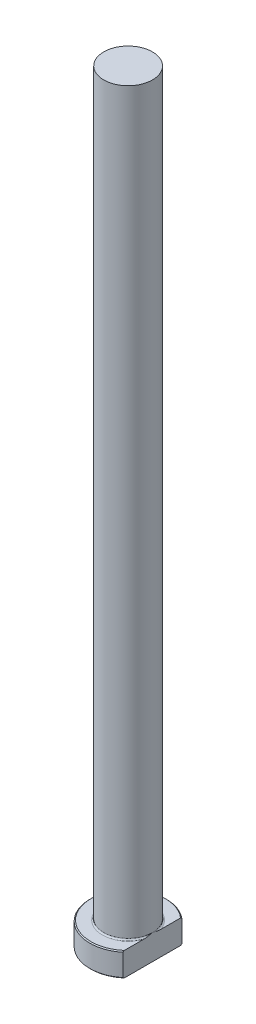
ISO-10303-21;
HEADER;
FILE_DESCRIPTION(('STEP AP214'),'2;1');
FILE_NAME('part.step','',(''),(''),'','','');
FILE_SCHEMA(('AUTOMOTIVE_DESIGN { 1 0 10303 214 1 1 1 1 }'));
ENDSEC;
DATA;
#1=APPLICATION_CONTEXT('core data for automotive mechanical design processes');
#2=APPLICATION_PROTOCOL_DEFINITION('international standard','automotive_design',2000,#1);
#3=PRODUCT_CONTEXT('',#1,'mechanical');
#4=PRODUCT('Part','Part','',(#3));
#5=PRODUCT_RELATED_PRODUCT_CATEGORY('part','',(#4));
#6=PRODUCT_DEFINITION_FORMATION('','',#4);
#7=PRODUCT_DEFINITION_CONTEXT('part definition',#1,'design');
#8=PRODUCT_DEFINITION('design','',#6,#7);
#9=PRODUCT_DEFINITION_SHAPE('','',#8);
#10=(LENGTH_UNIT() NAMED_UNIT(*) SI_UNIT(.MILLI.,.METRE.));
#11=(NAMED_UNIT(*) PLANE_ANGLE_UNIT() SI_UNIT($,.RADIAN.));
#12=(NAMED_UNIT(*) SI_UNIT($,.STERADIAN.) SOLID_ANGLE_UNIT());
#13=UNCERTAINTY_MEASURE_WITH_UNIT(LENGTH_MEASURE(1.E-05),#10,'distance_accuracy_value','');
#14=(GEOMETRIC_REPRESENTATION_CONTEXT(3) GLOBAL_UNCERTAINTY_ASSIGNED_CONTEXT((#13)) GLOBAL_UNIT_ASSIGNED_CONTEXT((#10,
#11,#12)) REPRESENTATION_CONTEXT('',''));
#15=CARTESIAN_POINT('',(0.,0.,0.));
#16=DIRECTION('',(0.,0.,1.));
#17=DIRECTION('',(1.,0.,0.));
#18=AXIS2_PLACEMENT_3D('',#15,#16,#17);
#19=CARTESIAN_POINT('',(0.,0.,0.));
#20=DIRECTION('',(0.,-1.,0.));
#21=DIRECTION('',(0.,0.,-1.));
#22=AXIS2_PLACEMENT_3D('',#19,#20,#21);
#23=PLANE('',#22);
#24=CARTESIAN_POINT('',(0.,0.,0.));
#25=DIRECTION('',(0.,-1.,0.));
#26=DIRECTION('',(0.,0.,-1.));
#27=AXIS2_PLACEMENT_3D('',#24,#25,#26);
#28=CIRCLE('',#27,7.79999999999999);
#29=CARTESIAN_POINT('',(5.09999999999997,0.,5.90169467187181));
#30=VERTEX_POINT('',#29);
#31=CARTESIAN_POINT('',(5.09999999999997,0.,-5.90169467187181));
#32=VERTEX_POINT('',#31);
#33=EDGE_CURVE('E98',#30,#32,#28,.T.);
#34=ORIENTED_EDGE('',*,*,#33,.T.);
#35=DIRECTION('',(0.,0.,1.));
#36=VECTOR('',#35,1.);
#37=CARTESIAN_POINT('',(5.09999999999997,0.,-6.16360284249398));
#38=LINE('',#37,#36);
#39=EDGE_CURVE('E83',#32,#30,#38,.T.);
#40=ORIENTED_EDGE('',*,*,#39,.T.);
#41=EDGE_LOOP('',(#34,#40));
#42=FACE_BOUND('',#41,.T.);
#43=ADVANCED_FACE('F32',(#42),#23,.T.);
#44=CARTESIAN_POINT('',(0.,259.958771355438,0.));
#45=DIRECTION('',(0.,1.,0.));
#46=DIRECTION('',(0.,0.,1.));
#47=AXIS2_PLACEMENT_3D('',#44,#45,#46);
#48=CYLINDRICAL_SURFACE('',#47,7.99999999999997);
#49=CARTESIAN_POINT('',(0.,4.79999999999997,0.));
#50=DIRECTION('',(0.,1.,0.));
#51=DIRECTION('',(0.,0.,1.));
#52=AXIS2_PLACEMENT_3D('',#49,#50,#51);
#53=CIRCLE('',#52,7.99999999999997);
#54=CARTESIAN_POINT('',(5.09999999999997,4.79999999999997,6.16360284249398));
#55=VERTEX_POINT('',#54);
#56=CARTESIAN_POINT('',(5.09999999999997,4.79999999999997,-6.16360284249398));
#57=VERTEX_POINT('',#56);
#58=EDGE_CURVE('E104',#55,#57,#53,.F.);
#59=ORIENTED_EDGE('',*,*,#58,.T.);
#60=DIRECTION('',(0.,-1.,0.));
#61=VECTOR('',#60,1.);
#62=CARTESIAN_POINT('',(5.09999999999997,160.,-6.16360284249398));
#63=LINE('',#62,#61);
#64=CARTESIAN_POINT('',(5.09999999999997,0.199999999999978,-6.16360284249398));
#65=VERTEX_POINT('',#64);
#66=EDGE_CURVE('E183',#57,#65,#63,.T.);
#67=ORIENTED_EDGE('',*,*,#66,.T.);
#68=CARTESIAN_POINT('',(0.,0.199999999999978,0.));
#69=DIRECTION('',(0.,-1.,0.));
#70=DIRECTION('',(0.,0.,-1.));
#71=AXIS2_PLACEMENT_3D('',#68,#69,#70);
#72=CIRCLE('',#71,7.99999999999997);
#73=CARTESIAN_POINT('',(5.09999999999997,0.199999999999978,6.16360284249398));
#74=VERTEX_POINT('',#73);
#75=EDGE_CURVE('E100',#65,#74,#72,.F.);
#76=ORIENTED_EDGE('',*,*,#75,.T.);
#77=DIRECTION('',(0.,-1.,0.));
#78=VECTOR('',#77,1.);
#79=CARTESIAN_POINT('',(5.09999999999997,160.,6.16360284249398));
#80=LINE('',#79,#78);
#81=EDGE_CURVE('E93',#55,#74,#80,.T.);
#82=ORIENTED_EDGE('',*,*,#81,.F.);
#83=EDGE_LOOP('',(#59,#67,#76,#82));
#84=FACE_BOUND('',#83,.T.);
#85=ADVANCED_FACE('F158',(#84),#48,.T.);
#86=CARTESIAN_POINT('',(-7.99999999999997,5.,0.));
#87=DIRECTION('',(0.,1.,0.));
#88=DIRECTION('',(0.,0.,1.));
#89=AXIS2_PLACEMENT_3D('',#86,#87,#88);
#90=PLANE('',#89);
#91=CARTESIAN_POINT('',(0.,5.,0.));
#92=DIRECTION('',(0.,1.,0.));
#93=DIRECTION('',(0.,0.,1.));
#94=AXIS2_PLACEMENT_3D('',#91,#92,#93);
#95=CIRCLE('',#94,7.79999999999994);
#96=CARTESIAN_POINT('',(5.09999999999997,5.,-5.90169467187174));
#97=VERTEX_POINT('',#96);
#98=CARTESIAN_POINT('',(5.09999999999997,5.,5.90169467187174));
#99=VERTEX_POINT('',#98);
#100=EDGE_CURVE('E178',#97,#99,#95,.T.);
#101=ORIENTED_EDGE('',*,*,#100,.T.);
#102=DIRECTION('',(0.,0.,-1.));
#103=VECTOR('',#102,1.);
#104=CARTESIAN_POINT('',(5.09999999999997,5.,0.));
#105=LINE('',#104,#103);
#106=CARTESIAN_POINT('',(5.09999999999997,4.99999999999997,1.77482393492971));
#107=VERTEX_POINT('',#106);
#108=EDGE_CURVE('E57',#99,#107,#105,.T.);
#109=ORIENTED_EDGE('',*,*,#108,.T.);
#110=CARTESIAN_POINT('',(0.,5.,0.));
#111=DIRECTION('',(0.,1.,0.));
#112=DIRECTION('',(0.,0.,1.));
#113=AXIS2_PLACEMENT_3D('',#110,#111,#112);
#114=CIRCLE('',#113,5.39999999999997);
#115=CARTESIAN_POINT('',(5.09999999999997,4.99999999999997,-1.77482393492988));
#116=VERTEX_POINT('',#115);
#117=EDGE_CURVE('E107',#107,#116,#114,.F.);
#118=ORIENTED_EDGE('',*,*,#117,.T.);
#119=EDGE_CURVE('E136',#116,#97,#105,.T.);
#120=ORIENTED_EDGE('',*,*,#119,.T.);
#121=EDGE_LOOP('',(#101,#109,#118,#120));
#122=FACE_BOUND('',#121,.T.);
#123=ADVANCED_FACE('F147',(#122),#90,.T.);
#124=CARTESIAN_POINT('',(0.,5.,0.));
#125=DIRECTION('',(0.,-1.,0.));
#126=DIRECTION('',(0.,0.,-1.));
#127=AXIS2_PLACEMENT_3D('',#124,#125,#126);
#128=CONICAL_SURFACE('',#127,7.79999999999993,0.785398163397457);
#129=ORIENTED_EDGE('',*,*,#58,.F.);
#130=CARTESIAN_POINT('',(5.09999999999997,-1.68838926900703,13.5610996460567));
#131=CARTESIAN_POINT('',(5.09999999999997,-1.49117445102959,13.3503958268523));
#132=CARTESIAN_POINT('',(5.09999999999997,-1.2942591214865,13.1394117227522));
#133=CARTESIAN_POINT('',(5.09999999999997,-0.901124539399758,12.7167935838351));
#134=CARTESIAN_POINT('',(5.09999999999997,-0.70490529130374,12.5051595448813));
#135=CARTESIAN_POINT('',(5.09999999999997,-0.117342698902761,11.8690459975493));
#136=CARTESIAN_POINT('',(5.09999999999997,0.272806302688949,11.4434608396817));
#137=CARTESIAN_POINT('',(5.09999999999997,1.05193640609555,10.5848872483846));
#138=CARTESIAN_POINT('',(5.09999999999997,1.4408822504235,10.1518667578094));
#139=CARTESIAN_POINT('',(5.09999999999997,2.21252525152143,9.28039822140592));
#140=CARTESIAN_POINT('',(5.09999999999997,2.59522339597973,8.84195105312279));
#141=CARTESIAN_POINT('',(5.09999999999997,3.28346545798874,8.03678680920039));
#142=CARTESIAN_POINT('',(5.09999999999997,3.59050446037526,7.67135442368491));
#143=CARTESIAN_POINT('',(5.09999999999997,4.0444414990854,7.11764573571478));
#144=CARTESIAN_POINT('',(5.09999999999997,4.19468098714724,6.93211011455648));
#145=CARTESIAN_POINT('',(5.09999999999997,4.49242146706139,6.55885365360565));
#146=CARTESIAN_POINT('',(5.09999999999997,4.63992249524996,6.37113284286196));
#147=CARTESIAN_POINT('',(5.09999999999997,4.93124846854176,5.99346825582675));
#148=CARTESIAN_POINT('',(5.09999999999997,5.07508033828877,5.80352983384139));
#149=CARTESIAN_POINT('',(5.09999999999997,5.35853965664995,5.42051054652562));
#150=CARTESIAN_POINT('',(5.09999999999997,5.49816682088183,5.22742946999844));
#151=CARTESIAN_POINT('',(5.09999999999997,5.77196390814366,4.83761664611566));
#152=CARTESIAN_POINT('',(5.09999999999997,5.90613746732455,4.64088746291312));
#153=CARTESIAN_POINT('',(5.09999999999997,6.16753864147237,4.2428863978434));
#154=CARTESIAN_POINT('',(5.09999999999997,6.29476755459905,4.04161537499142));
#155=CARTESIAN_POINT('',(5.09999999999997,6.51869473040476,3.66918005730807));
#156=CARTESIAN_POINT('',(5.09999999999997,6.61684568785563,3.498893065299));
#157=CARTESIAN_POINT('',(5.09999999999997,6.8052862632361,3.15396122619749));
#158=CARTESIAN_POINT('',(5.09999999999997,6.89557493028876,2.9793158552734));
#159=CARTESIAN_POINT('',(5.09999999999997,7.06604933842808,2.62530631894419));
#160=CARTESIAN_POINT('',(5.09999999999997,7.14624387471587,2.4459464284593));
#161=CARTESIAN_POINT('',(5.09999999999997,7.29389284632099,2.08202755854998));
#162=CARTESIAN_POINT('',(5.09999999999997,7.36135077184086,1.89747001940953));
#163=CARTESIAN_POINT('',(5.09999999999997,7.46787946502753,1.56242413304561));
#164=CARTESIAN_POINT('',(5.09999999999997,7.50993657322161,1.41289089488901));
#165=CARTESIAN_POINT('',(5.09999999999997,7.5824422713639,1.11101527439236));
#166=CARTESIAN_POINT('',(5.09999999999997,7.61289239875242,0.958673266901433));
#167=CARTESIAN_POINT('',(5.09999999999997,7.66066060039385,0.652384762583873));
#168=CARTESIAN_POINT('',(5.09999999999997,7.67801796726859,0.498444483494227));
#169=CARTESIAN_POINT('',(5.09999999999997,7.69880109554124,0.189616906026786));
#170=CARTESIAN_POINT('',(5.09999999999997,7.70222744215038,0.0347296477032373));
#171=CARTESIAN_POINT('',(5.09999999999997,7.69494415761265,-0.274953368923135));
#172=CARTESIAN_POINT('',(5.09999999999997,7.68421202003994,-0.429748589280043));
#173=CARTESIAN_POINT('',(5.09999999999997,7.6491851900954,-0.737784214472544));
#174=CARTESIAN_POINT('',(5.09999999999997,7.62488939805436,-0.891024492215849));
#175=CARTESIAN_POINT('',(5.09999999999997,7.5638927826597,-1.19546940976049));
#176=CARTESIAN_POINT('',(5.09999999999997,7.52715417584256,-1.34666637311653));
#177=CARTESIAN_POINT('',(5.09999999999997,7.44288917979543,-1.64598767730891));
#178=CARTESIAN_POINT('',(5.09999999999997,7.39536249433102,-1.79411193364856));
#179=CARTESIAN_POINT('',(5.09999999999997,7.28286361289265,-2.110452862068));
#180=CARTESIAN_POINT('',(5.09999999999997,7.216317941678,-2.27810587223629));
#181=CARTESIAN_POINT('',(5.09999999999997,7.07327742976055,-2.60914825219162));
#182=CARTESIAN_POINT('',(5.09999999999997,6.99677812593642,-2.77253566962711));
#183=CARTESIAN_POINT('',(5.09999999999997,6.83568399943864,-3.09559415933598));
#184=CARTESIAN_POINT('',(5.09999999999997,6.75107532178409,-3.25525827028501));
#185=CARTESIAN_POINT('',(5.09999999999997,6.57547395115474,-3.57098467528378));
#186=CARTESIAN_POINT('',(5.09999999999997,6.48448213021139,-3.72704745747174));
#187=CARTESIAN_POINT('',(5.09999999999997,6.29613682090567,-4.03803676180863));
#188=CARTESIAN_POINT('',(5.09999999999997,6.19871627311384,-4.19292248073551));
#189=CARTESIAN_POINT('',(5.09999999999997,5.99959202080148,-4.49991023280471));
#190=CARTESIAN_POINT('',(5.09999999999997,5.89788820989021,-4.65201219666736));
#191=CARTESIAN_POINT('',(5.09999999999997,5.69108681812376,-4.95365388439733));
#192=CARTESIAN_POINT('',(5.09999999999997,5.58599284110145,-5.10319608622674));
#193=CARTESIAN_POINT('',(5.09999999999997,5.37292107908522,-5.40020343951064));
#194=CARTESIAN_POINT('',(5.09999999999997,5.26494333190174,-5.54766861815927));
#195=CARTESIAN_POINT('',(5.09999999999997,5.02178839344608,-5.87409503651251));
#196=CARTESIAN_POINT('',(5.09999999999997,4.88600343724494,-6.05260304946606));
#197=CARTESIAN_POINT('',(5.09999999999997,4.61149829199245,-6.40735082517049));
#198=CARTESIAN_POINT('',(5.09999999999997,4.47277800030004,-6.58359050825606));
#199=CARTESIAN_POINT('',(5.09999999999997,4.05300130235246,-7.10948762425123));
#200=CARTESIAN_POINT('',(5.09999999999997,3.76835961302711,-7.45628264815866));
#201=CARTESIAN_POINT('',(5.09999999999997,3.19218529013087,-8.1446559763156));
#202=CARTESIAN_POINT('',(5.09999999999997,2.90064601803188,-8.48622868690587));
#203=CARTESIAN_POINT('',(5.09999999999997,2.31275375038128,-9.16521513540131));
#204=CARTESIAN_POINT('',(5.09999999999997,2.01640062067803,-9.50262875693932));
#205=CARTESIAN_POINT('',(5.09999999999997,1.4387714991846,-10.1532482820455));
#206=CARTESIAN_POINT('',(5.09999999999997,1.15771277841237,-10.4666475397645));
#207=CARTESIAN_POINT('',(5.09999999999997,0.59313333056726,-11.0912313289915));
#208=CARTESIAN_POINT('',(5.09999999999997,0.309612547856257,-11.4024158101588));
#209=CARTESIAN_POINT('',(5.09999999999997,-0.258772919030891,-12.0223487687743));
#210=CARTESIAN_POINT('',(5.09999999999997,-0.543633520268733,-12.3311009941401));
#211=CARTESIAN_POINT('',(5.09999999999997,-1.11492174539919,-12.9471274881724));
#212=CARTESIAN_POINT('',(5.09999999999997,-1.40134929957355,-13.2544018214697));
#213=CARTESIAN_POINT('',(5.09999999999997,-1.68838926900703,-13.5610996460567));
#214=B_SPLINE_CURVE_WITH_KNOTS('',3,(#130,#131,#132,#133,#134,#135,#136,#137,#138,#139,#140,
#141,#142,#143,#144,#145,#146,#147,#148,#149,#150,#151,#152,#153,#154,#155,#156,#157,#158,#159,
#160,#161,#162,#163,#164,#165,#166,#167,#168,#169,#170,#171,#172,#173,#174,#175,#176,#177,#178,
#179,#180,#181,#182,#183,#184,#185,#186,#187,#188,#189,#190,#191,#192,#193,#194,#195,#196,#197,
#198,#199,#200,#201,#202,#203,#204,#205,#206,#207,#208,#209,#210,#211,#212,#213),.UNSPECIFIED.,
.F.,.F.,(4,2,2,2,2,2,2,2,2,2,2,2,2,2,2,2,2,2,2,2,2,2,2,2,2,2,2,2,2,2,2,2,2,2,2,2,2,2,2,2,2,4),
(0.,0.865798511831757,1.73160254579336,3.46364563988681,5.20976443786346,6.95560446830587,
8.38738766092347,9.10357880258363,9.8197604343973,10.5344719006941,11.2492315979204,
11.9635066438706,12.6776477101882,13.2671324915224,13.8566884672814,14.4457271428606,
15.0346041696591,15.5002159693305,15.9657660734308,16.4299133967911,16.8940412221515,
17.3589077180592,17.8238119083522,18.2901406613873,18.756482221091,19.2972067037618,
19.8381744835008,20.380083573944,20.9219187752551,21.4707620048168,22.0196188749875,
22.567910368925,23.1161946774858,23.7890028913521,24.4618346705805,25.807650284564,
27.1548185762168,28.5020244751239,29.7649097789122,31.0278236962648,32.2880803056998,
33.5482812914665),.UNSPECIFIED.);
#215=EDGE_CURVE('E135',#55,#99,#214,.T.);
#216=ORIENTED_EDGE('',*,*,#215,.T.);
#217=ORIENTED_EDGE('',*,*,#100,.F.);
#218=EDGE_CURVE('E127',#97,#57,#214,.T.);
#219=ORIENTED_EDGE('',*,*,#218,.T.);
#220=EDGE_LOOP('',(#129,#216,#217,#219));
#221=FACE_BOUND('',#220,.T.);
#222=ADVANCED_FACE('F143',(#221),#128,.T.);
#223=CARTESIAN_POINT('',(0.,0.199999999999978,0.));
#224=DIRECTION('',(0.,1.,0.));
#225=DIRECTION('',(0.,0.,1.));
#226=AXIS2_PLACEMENT_3D('',#223,#224,#225);
#227=CONICAL_SURFACE('',#226,7.99999999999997,0.785398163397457);
#228=ORIENTED_EDGE('',*,*,#75,.F.);
#229=CARTESIAN_POINT('',(5.09999999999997,6.68838926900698,-13.5610996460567));
#230=CARTESIAN_POINT('',(5.09999999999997,6.49117445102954,-13.3503958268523));
#231=CARTESIAN_POINT('',(5.09999999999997,6.29425912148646,-13.1394117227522));
#232=CARTESIAN_POINT('',(5.09999999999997,5.90112453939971,-12.7167935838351));
#233=CARTESIAN_POINT('',(5.09999999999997,5.70490529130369,-12.5051595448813));
#234=CARTESIAN_POINT('',(5.09999999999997,5.11734269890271,-11.8690459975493));
#235=CARTESIAN_POINT('',(5.09999999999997,4.727193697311,-11.4434608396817));
#236=CARTESIAN_POINT('',(5.09999999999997,3.9480635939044,-10.5848872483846));
#237=CARTESIAN_POINT('',(5.09999999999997,3.55911774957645,-10.1518667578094));
#238=CARTESIAN_POINT('',(5.09999999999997,2.78747474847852,-9.28039822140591));
#239=CARTESIAN_POINT('',(5.09999999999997,2.40477660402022,-8.84195105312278));
#240=CARTESIAN_POINT('',(5.09999999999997,1.7165345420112,-8.03678680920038));
#241=CARTESIAN_POINT('',(5.09999999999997,1.40949553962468,-7.67135442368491));
#242=CARTESIAN_POINT('',(5.09999999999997,0.955558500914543,-7.11764573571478));
#243=CARTESIAN_POINT('',(5.09999999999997,0.805319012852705,-6.93211011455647));
#244=CARTESIAN_POINT('',(5.09999999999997,0.507578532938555,-6.55885365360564));
#245=CARTESIAN_POINT('',(5.09999999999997,0.360077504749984,-6.37113284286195));
#246=CARTESIAN_POINT('',(5.09999999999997,0.0687515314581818,-5.99346825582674));
#247=CARTESIAN_POINT('',(5.09999999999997,-0.0750803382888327,-5.80352983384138));
#248=CARTESIAN_POINT('',(5.09999999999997,-0.358539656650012,-5.42051054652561));
#249=CARTESIAN_POINT('',(5.09999999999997,-0.498166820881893,-5.22742946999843));
#250=CARTESIAN_POINT('',(5.09999999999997,-0.771963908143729,-4.83761664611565));
#251=CARTESIAN_POINT('',(5.09999999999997,-0.906137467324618,-4.6408874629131));
#252=CARTESIAN_POINT('',(5.09999999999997,-1.16753864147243,-4.24288639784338));
#253=CARTESIAN_POINT('',(5.09999999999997,-1.29476755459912,-4.0416153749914));
#254=CARTESIAN_POINT('',(5.09999999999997,-1.51869473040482,-3.66918005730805));
#255=CARTESIAN_POINT('',(5.09999999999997,-1.61684568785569,-3.49889306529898));
#256=CARTESIAN_POINT('',(5.09999999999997,-1.80528626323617,-3.15396122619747));
#257=CARTESIAN_POINT('',(5.09999999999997,-1.89557493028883,-2.97931585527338));
#258=CARTESIAN_POINT('',(5.09999999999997,-2.06604933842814,-2.62530631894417));
#259=CARTESIAN_POINT('',(5.09999999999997,-2.14624387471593,-2.44594642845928));
#260=CARTESIAN_POINT('',(5.09999999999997,-2.29389284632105,-2.08202755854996));
#261=CARTESIAN_POINT('',(5.09999999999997,-2.36135077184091,-1.89747001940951));
#262=CARTESIAN_POINT('',(5.09999999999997,-2.46787946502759,-1.56242413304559));
#263=CARTESIAN_POINT('',(5.09999999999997,-2.50993657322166,-1.41289089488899));
#264=CARTESIAN_POINT('',(5.09999999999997,-2.58244227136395,-1.11101527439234));
#265=CARTESIAN_POINT('',(5.09999999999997,-2.61289239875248,-0.958673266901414));
#266=CARTESIAN_POINT('',(5.09999999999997,-2.66066060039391,-0.652384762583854));
#267=CARTESIAN_POINT('',(5.09999999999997,-2.67801796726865,-0.498444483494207));
#268=CARTESIAN_POINT('',(5.09999999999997,-2.69880109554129,-0.189616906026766));
#269=CARTESIAN_POINT('',(5.09999999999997,-2.70222744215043,-0.0347296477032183));
#270=CARTESIAN_POINT('',(5.09999999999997,-2.6949441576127,0.274953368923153));
#271=CARTESIAN_POINT('',(5.09999999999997,-2.68421202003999,0.429748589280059));
#272=CARTESIAN_POINT('',(5.09999999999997,-2.64918519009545,0.737784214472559));
#273=CARTESIAN_POINT('',(5.09999999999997,-2.62488939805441,0.891024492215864));
#274=CARTESIAN_POINT('',(5.09999999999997,-2.56389278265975,1.19546940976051));
#275=CARTESIAN_POINT('',(5.09999999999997,-2.52715417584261,1.34666637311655));
#276=CARTESIAN_POINT('',(5.09999999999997,-2.44288917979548,1.64598767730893));
#277=CARTESIAN_POINT('',(5.09999999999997,-2.39536249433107,1.79411193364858));
#278=CARTESIAN_POINT('',(5.09999999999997,-2.2828636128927,2.11045286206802));
#279=CARTESIAN_POINT('',(5.09999999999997,-2.21631794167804,2.2781058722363));
#280=CARTESIAN_POINT('',(5.09999999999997,-2.07327742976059,2.60914825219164));
#281=CARTESIAN_POINT('',(5.09999999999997,-1.99677812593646,2.77253566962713));
#282=CARTESIAN_POINT('',(5.09999999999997,-1.83568399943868,3.095594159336));
#283=CARTESIAN_POINT('',(5.09999999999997,-1.75107532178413,3.25525827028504));
#284=CARTESIAN_POINT('',(5.09999999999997,-1.57547395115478,3.5709846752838));
#285=CARTESIAN_POINT('',(5.09999999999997,-1.48448213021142,3.72704745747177));
#286=CARTESIAN_POINT('',(5.09999999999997,-1.29613682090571,4.03803676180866));
#287=CARTESIAN_POINT('',(5.09999999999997,-1.19871627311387,4.19292248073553));
#288=CARTESIAN_POINT('',(5.09999999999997,-0.999592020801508,4.49991023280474));
#289=CARTESIAN_POINT('',(5.09999999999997,-0.897888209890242,4.65201219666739));
#290=CARTESIAN_POINT('',(5.09999999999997,-0.691086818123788,4.95365388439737));
#291=CARTESIAN_POINT('',(5.09999999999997,-0.585992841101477,5.10319608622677));
#292=CARTESIAN_POINT('',(5.09999999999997,-0.372921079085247,5.40020343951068));
#293=CARTESIAN_POINT('',(5.09999999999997,-0.264943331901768,5.54766861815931));
#294=CARTESIAN_POINT('',(5.09999999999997,-0.0217883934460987,5.87409503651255));
#295=CARTESIAN_POINT('',(5.09999999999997,0.113996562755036,6.0526030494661));
#296=CARTESIAN_POINT('',(5.09999999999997,0.388501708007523,6.40735082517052));
#297=CARTESIAN_POINT('',(5.09999999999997,0.527221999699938,6.58359050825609));
#298=CARTESIAN_POINT('',(5.09999999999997,0.946998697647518,7.10948762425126));
#299=CARTESIAN_POINT('',(5.09999999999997,1.23164038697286,7.45628264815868));
#300=CARTESIAN_POINT('',(5.09999999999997,1.8078147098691,8.14465597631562));
#301=CARTESIAN_POINT('',(5.09999999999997,2.09935398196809,8.4862286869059));
#302=CARTESIAN_POINT('',(5.09999999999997,2.68724624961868,9.16521513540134));
#303=CARTESIAN_POINT('',(5.09999999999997,2.98359937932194,9.50262875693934));
#304=CARTESIAN_POINT('',(5.09999999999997,3.56122850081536,10.1532482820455));
#305=CARTESIAN_POINT('',(5.09999999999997,3.84228722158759,10.4666475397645));
#306=CARTESIAN_POINT('',(5.09999999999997,4.4068666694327,11.0912313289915));
#307=CARTESIAN_POINT('',(5.09999999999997,4.6903874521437,11.4024158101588));
#308=CARTESIAN_POINT('',(5.09999999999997,5.25877291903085,12.0223487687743));
#309=CARTESIAN_POINT('',(5.09999999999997,5.54363352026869,12.3311009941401));
#310=CARTESIAN_POINT('',(5.09999999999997,6.11492174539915,12.9471274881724));
#311=CARTESIAN_POINT('',(5.09999999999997,6.4013492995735,13.2544018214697));
#312=CARTESIAN_POINT('',(5.09999999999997,6.68838926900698,13.5610996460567));
#313=B_SPLINE_CURVE_WITH_KNOTS('',3,(#229,#230,#231,#232,#233,#234,#235,#236,#237,#238,#239,
#240,#241,#242,#243,#244,#245,#246,#247,#248,#249,#250,#251,#252,#253,#254,#255,#256,#257,#258,
#259,#260,#261,#262,#263,#264,#265,#266,#267,#268,#269,#270,#271,#272,#273,#274,#275,#276,#277,
#278,#279,#280,#281,#282,#283,#284,#285,#286,#287,#288,#289,#290,#291,#292,#293,#294,#295,#296,
#297,#298,#299,#300,#301,#302,#303,#304,#305,#306,#307,#308,#309,#310,#311,#312),.UNSPECIFIED.,
.F.,.F.,(4,2,2,2,2,2,2,2,2,2,2,2,2,2,2,2,2,2,2,2,2,2,2,2,2,2,2,2,2,2,2,2,2,2,2,2,2,2,2,2,2,4),
(0.,0.865798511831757,1.73160254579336,3.4636456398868,5.20976443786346,6.95560446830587,
8.38738766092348,9.10357880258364,9.81976043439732,10.5344719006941,11.2492315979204,
11.9635066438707,12.6776477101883,13.2671324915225,13.8566884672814,14.4457271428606,
15.0346041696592,15.5002159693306,15.9657660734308,16.4299133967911,16.8940412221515,
17.3589077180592,17.8238119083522,18.2901406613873,18.7564822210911,19.2972067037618,
19.8381744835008,20.380083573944,20.9219187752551,21.4707620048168,22.0196188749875,
22.567910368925,23.1161946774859,23.7890028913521,24.4618346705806,25.8076502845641,
27.1548185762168,28.5020244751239,29.7649097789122,31.0278236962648,32.2880803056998,
33.5482812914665),.UNSPECIFIED.);
#314=EDGE_CURVE('E86',#65,#32,#313,.T.);
#315=ORIENTED_EDGE('',*,*,#314,.T.);
#316=ORIENTED_EDGE('',*,*,#33,.F.);
#317=EDGE_CURVE('E89',#30,#74,#313,.T.);
#318=ORIENTED_EDGE('',*,*,#317,.T.);
#319=EDGE_LOOP('',(#228,#315,#316,#318));
#320=FACE_BOUND('',#319,.T.);
#321=ADVANCED_FACE('F97',(#320),#227,.T.);
#322=CARTESIAN_POINT('',(0.,5.29999999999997,0.));
#323=DIRECTION('',(0.,1.,0.));
#324=DIRECTION('',(0.,0.,1.));
#325=AXIS2_PLACEMENT_3D('',#322,#323,#324);
#326=TOROIDAL_SURFACE('',#325,5.39999999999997,0.3);
#327=CARTESIAN_POINT('',(5.09999999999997,5.29999999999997,0.));
#328=CARTESIAN_POINT('',(5.09999999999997,5.30000062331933,1.00502455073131E-10));
#329=CARTESIAN_POINT('',(5.09999999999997,5.30000124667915,-2.56272245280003E-07));
#330=CARTESIAN_POINT('',(5.09999999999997,5.30000240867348,-9.58155656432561E-07));
#331=CARTESIAN_POINT('',(5.09999999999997,5.30000293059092,-1.42128215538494E-06));
#332=CARTESIAN_POINT('',(5.09999999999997,5.30000402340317,-2.53262703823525E-06));
#333=CARTESIAN_POINT('',(5.09999999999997,5.30000457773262,-3.19888437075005E-06));
#334=CARTESIAN_POINT('',(5.09999999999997,5.3000055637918,-4.57422758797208E-06));
#335=CARTESIAN_POINT('',(5.09999999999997,5.3000059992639,-5.28085592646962E-06));
#336=CARTESIAN_POINT('',(5.09999999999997,5.3000076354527,-8.04031793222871E-06));
#337=CARTESIAN_POINT('',(5.09999999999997,5.30000874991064,-1.01478584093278E-05));
#338=CARTESIAN_POINT('',(5.09999999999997,5.30001056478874,-1.43037796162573E-05));
#339=CARTESIAN_POINT('',(5.09999999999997,5.30001129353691,-1.63402753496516E-05));
#340=CARTESIAN_POINT('',(5.09999999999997,5.30001438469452,-2.50239477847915E-05));
#341=CARTESIAN_POINT('',(5.09999999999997,5.30001671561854,-3.16857680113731E-05));
#342=CARTESIAN_POINT('',(5.09999999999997,5.30002011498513,-4.42245824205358E-05));
#343=CARTESIAN_POINT('',(5.09999999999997,5.30002132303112,-5.00633656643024E-05));
#344=CARTESIAN_POINT('',(5.09999999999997,5.30003017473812,-9.36444945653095E-05));
#345=CARTESIAN_POINT('',(5.09999999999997,5.30003694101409,-0.000131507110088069));
#346=CARTESIAN_POINT('',(5.09999999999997,5.30006656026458,-0.000281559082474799));
#347=CARTESIAN_POINT('',(5.09999999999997,5.30009476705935,-0.000392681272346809));
#348=CARTESIAN_POINT('',(5.09999999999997,5.30020497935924,-0.000834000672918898));
#349=CARTESIAN_POINT('',(5.09999999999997,5.30028356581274,-0.00116477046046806));
#350=CARTESIAN_POINT('',(5.09999999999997,5.3005991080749,-0.0024833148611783));
#351=CARTESIAN_POINT('',(5.09999999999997,5.30084040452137,-0.00347033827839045));
#352=CARTESIAN_POINT('',(5.09999999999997,5.30184681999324,-0.00759777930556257));
#353=CARTESIAN_POINT('',(5.09999999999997,5.30260646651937,-0.0107391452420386));
#354=CARTESIAN_POINT('',(5.09999999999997,5.30990583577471,-0.0409103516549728));
#355=CARTESIAN_POINT('',(5.09999999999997,5.31647007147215,-0.0679360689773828));
#356=CARTESIAN_POINT('',(5.09999999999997,5.32929459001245,-0.120902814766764));
#357=CARTESIAN_POINT('',(5.09999999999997,5.33555642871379,-0.146843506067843));
#358=CARTESIAN_POINT('',(5.09999999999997,5.34884216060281,-0.202060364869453));
#359=CARTESIAN_POINT('',(5.09999999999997,5.35586083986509,-0.231337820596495));
#360=CARTESIAN_POINT('',(5.09999999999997,5.36989412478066,-0.290236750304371));
#361=CARTESIAN_POINT('',(5.09999999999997,5.37690782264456,-0.319858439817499));
#362=CARTESIAN_POINT('',(5.09999999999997,5.39370531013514,-0.391396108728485));
#363=CARTESIAN_POINT('',(5.09999999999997,5.40343385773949,-0.433325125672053));
#364=CARTESIAN_POINT('',(5.09999999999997,5.42233571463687,-0.51616106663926));
#365=CARTESIAN_POINT('',(5.09999999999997,5.43151688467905,-0.55706619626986));
#366=CARTESIAN_POINT('',(5.09999999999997,5.45452080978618,-0.661777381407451));
#367=CARTESIAN_POINT('',(5.09999999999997,5.46807892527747,-0.725642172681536));
#368=CARTESIAN_POINT('',(5.09999999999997,5.4940673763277,-0.854162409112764));
#369=CARTESIAN_POINT('',(5.09999999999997,5.5064872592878,-0.918819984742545));
#370=CARTESIAN_POINT('',(5.09999999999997,5.53078685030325,-1.05464624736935));
#371=CARTESIAN_POINT('',(5.09999999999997,5.5425007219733,-1.12584508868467));
#372=CARTESIAN_POINT('',(5.09999999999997,5.56331904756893,-1.2686184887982));
#373=CARTESIAN_POINT('',(5.09999999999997,5.57242395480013,-1.34019298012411));
#374=CARTESIAN_POINT('',(5.09999999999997,5.58708832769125,-1.48237032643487));
#375=CARTESIAN_POINT('',(5.09999999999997,5.59271078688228,-1.55296638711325));
#376=CARTESIAN_POINT('',(5.09999999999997,5.59964105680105,-1.69455989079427));
#377=CARTESIAN_POINT('',(5.09999999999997,5.60093824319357,-1.7655578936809));
#378=CARTESIAN_POINT('',(5.09999999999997,5.59769411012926,-1.90544222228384));
#379=CARTESIAN_POINT('',(5.09999999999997,5.59332114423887,-1.97433003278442));
#380=CARTESIAN_POINT('',(5.09999999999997,5.58075096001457,-2.07681569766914));
#381=CARTESIAN_POINT('',(5.09999999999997,5.57557260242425,-2.11078113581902));
#382=CARTESIAN_POINT('',(5.09999999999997,5.56270516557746,-2.17822373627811));
#383=CARTESIAN_POINT('',(5.09999999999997,5.55501865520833,-2.21170136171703));
#384=CARTESIAN_POINT('',(5.09999999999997,5.54146504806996,-2.25971093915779));
#385=CARTESIAN_POINT('',(5.09999999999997,5.53689562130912,-2.27460808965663));
#386=CARTESIAN_POINT('',(5.09999999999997,5.52697250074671,-2.30414012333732));
#387=CARTESIAN_POINT('',(5.09999999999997,5.52161846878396,-2.31877489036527));
#388=CARTESIAN_POINT('',(5.09999999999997,5.50422688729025,-2.36209889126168));
#389=CARTESIAN_POINT('',(5.09999999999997,5.49083502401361,-2.3903019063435));
#390=CARTESIAN_POINT('',(5.09999999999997,5.46786086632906,-2.42877296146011));
#391=CARTESIAN_POINT('',(5.09999999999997,5.4603260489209,-2.44026309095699));
#392=CARTESIAN_POINT('',(5.09999999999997,5.44403681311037,-2.46240090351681));
#393=CARTESIAN_POINT('',(5.09999999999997,5.43527992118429,-2.47304680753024));
#394=CARTESIAN_POINT('',(5.09999999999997,5.41620529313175,-2.49317992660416));
#395=CARTESIAN_POINT('',(5.09999999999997,5.40586565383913,-2.50264683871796));
#396=CARTESIAN_POINT('',(5.09999999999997,5.3835690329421,-2.5194267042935));
#397=CARTESIAN_POINT('',(5.09999999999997,5.37162091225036,-2.5267508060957));
#398=CARTESIAN_POINT('',(5.09999999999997,5.35166538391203,-2.53574339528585));
#399=CARTESIAN_POINT('',(5.09999999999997,5.34414545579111,-2.53849221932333));
#400=CARTESIAN_POINT('',(5.09999999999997,5.32875362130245,-2.54271562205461));
#401=CARTESIAN_POINT('',(5.09999999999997,5.32088204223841,-2.5441913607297));
#402=CARTESIAN_POINT('',(5.09999999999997,5.30496570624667,-2.54573009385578));
#403=CARTESIAN_POINT('',(5.09999999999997,5.29692036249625,-2.54578715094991));
#404=CARTESIAN_POINT('',(5.09999999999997,5.28094771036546,-2.54446730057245));
#405=CARTESIAN_POINT('',(5.09999999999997,5.27302044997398,-2.54308982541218));
#406=CARTESIAN_POINT('',(5.09999999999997,5.25787452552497,-2.53913219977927));
#407=CARTESIAN_POINT('',(5.09999999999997,5.25064005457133,-2.53661104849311));
#408=CARTESIAN_POINT('',(5.09999999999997,5.23660403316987,-2.53057544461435));
#409=CARTESIAN_POINT('',(5.09999999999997,5.22980263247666,-2.52706065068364));
#410=CARTESIAN_POINT('',(5.09999999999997,5.21241680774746,-2.51668428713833));
#411=CARTESIAN_POINT('',(5.09999999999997,5.20224553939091,-2.50913195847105));
#412=CARTESIAN_POINT('',(5.09999999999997,5.18317971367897,-2.49255314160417));
#413=CARTESIAN_POINT('',(5.09999999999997,5.17428964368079,-2.48352169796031));
#414=CARTESIAN_POINT('',(5.09999999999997,5.15120222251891,-2.45711400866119));
#415=CARTESIAN_POINT('',(5.09999999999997,5.13821905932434,-2.43868687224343));
#416=CARTESIAN_POINT('',(5.09999999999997,5.11496748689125,-2.40025423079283));
#417=CARTESIAN_POINT('',(5.09999999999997,5.10470258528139,-2.38024672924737));
#418=CARTESIAN_POINT('',(5.09999999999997,5.08559509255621,-2.33784185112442));
#419=CARTESIAN_POINT('',(5.09999999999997,5.07690690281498,-2.31537591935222));
#420=CARTESIAN_POINT('',(5.09999999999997,5.06139749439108,-2.26979738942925));
#421=CARTESIAN_POINT('',(5.09999999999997,5.05457848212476,-2.24668406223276));
#422=CARTESIAN_POINT('',(5.09999999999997,5.04239975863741,-2.1998307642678));
#423=CARTESIAN_POINT('',(5.09999999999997,5.03705561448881,-2.17608680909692));
#424=CARTESIAN_POINT('',(5.09999999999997,5.02766167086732,-2.12836719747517));
#425=CARTESIAN_POINT('',(5.09999999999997,5.02361095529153,-2.10439171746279));
#426=CARTESIAN_POINT('',(5.09999999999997,5.01439130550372,-2.04113234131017));
#427=CARTESIAN_POINT('',(5.09999999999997,5.01012481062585,-2.00171697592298));
#428=CARTESIAN_POINT('',(5.09999999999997,5.00388663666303,-1.92269917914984));
#429=CARTESIAN_POINT('',(5.09999999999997,5.00191621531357,-1.88309665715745));
#430=CARTESIAN_POINT('',(5.09999999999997,4.99879803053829,-1.76395655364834));
#431=CARTESIAN_POINT('',(5.09999999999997,5.00047462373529,-1.68434528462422));
#432=CARTESIAN_POINT('',(5.09999999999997,5.00888754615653,-1.52975473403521));
#433=CARTESIAN_POINT('',(5.09999999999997,5.01534627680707,-1.45475708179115));
#434=CARTESIAN_POINT('',(5.09999999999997,5.0317664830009,-1.30572790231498));
#435=CARTESIAN_POINT('',(5.09999999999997,5.04170115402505,-1.23169335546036));
#436=CARTESIAN_POINT('',(5.09999999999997,5.06541265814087,-1.07626149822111));
#437=CARTESIAN_POINT('',(5.09999999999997,5.07948398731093,-0.99491013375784));
#438=CARTESIAN_POINT('',(5.09999999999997,5.10254680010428,-0.872231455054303));
#439=CARTESIAN_POINT('',(5.09999999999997,5.11066831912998,-0.830736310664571));
#440=CARTESIAN_POINT('',(5.09999999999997,5.12745388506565,-0.747740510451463));
#441=CARTESIAN_POINT('',(5.09999999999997,5.13611932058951,-0.706240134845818));
#442=CARTESIAN_POINT('',(5.09999999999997,5.15735306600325,-0.607104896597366));
#443=CARTESIAN_POINT('',(5.09999999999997,5.17012138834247,-0.549513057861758));
#444=CARTESIAN_POINT('',(5.09999999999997,5.19610836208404,-0.435113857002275));
#445=CARTESIAN_POINT('',(5.09999999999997,5.20932032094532,-0.378304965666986));
#446=CARTESIAN_POINT('',(5.09999999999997,5.23456914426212,-0.271298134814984));
#447=CARTESIAN_POINT('',(5.09999999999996,5.24656654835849,-0.221090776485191));
#448=CARTESIAN_POINT('',(5.09999999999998,5.27126433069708,-0.118550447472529));
#449=CARTESIAN_POINT('',(5.10000000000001,5.28397269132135,-0.0662193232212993));
#450=CARTESIAN_POINT('',(5.09999999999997,5.29739466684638,-0.0107340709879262));
#451=CARTESIAN_POINT('',(5.09999999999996,5.29815561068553,-0.00758765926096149));
#452=CARTESIAN_POINT('',(5.09999999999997,5.29916232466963,-0.00345908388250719));
#453=CARTESIAN_POINT('',(5.09999999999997,5.29940265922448,-0.00247597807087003));
#454=CARTESIAN_POINT('',(5.09999999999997,5.29971703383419,-0.00116231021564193));
#455=CARTESIAN_POINT('',(5.09999999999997,5.29979539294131,-0.000832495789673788));
#456=CARTESIAN_POINT('',(5.09999999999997,5.29990533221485,-0.000392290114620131));
#457=CARTESIAN_POINT('',(5.09999999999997,5.29993350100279,-0.000281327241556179));
#458=CARTESIAN_POINT('',(5.09999999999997,5.29996308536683,-0.000131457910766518));
#459=CARTESIAN_POINT('',(5.09999999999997,5.29996984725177,-9.36171898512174E-05));
#460=CARTESIAN_POINT('',(5.09999999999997,5.29997868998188,-5.00584682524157E-05));
#461=CARTESIAN_POINT('',(5.09999999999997,5.2999798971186,-4.42208592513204E-05));
#462=CARTESIAN_POINT('',(5.09999999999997,5.29998329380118,-3.16844912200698E-05));
#463=CARTESIAN_POINT('',(5.09999999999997,5.29998562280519,-2.50238809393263E-05));
#464=CARTESIAN_POINT('',(5.09999999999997,5.29998871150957,-1.63414750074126E-05));
#465=CARTESIAN_POINT('',(5.09999999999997,5.29998943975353,-1.43050668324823E-05));
#466=CARTESIAN_POINT('',(5.09999999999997,5.29999125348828,-1.01492415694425E-05));
#467=CARTESIAN_POINT('',(5.09999999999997,5.29999236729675,-8.04169787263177E-06));
#468=CARTESIAN_POINT('',(5.09999999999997,5.29999400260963,-5.28214008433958E-06));
#469=CARTESIAN_POINT('',(5.09999999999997,5.2999944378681,-4.57545909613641E-06));
#470=CARTESIAN_POINT('',(5.09999999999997,5.29999542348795,-3.19997201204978E-06));
#471=CARTESIAN_POINT('',(5.09999999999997,5.29999597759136,-2.53362183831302E-06));
#472=CARTESIAN_POINT('',(5.09999999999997,5.2999970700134,-1.42206069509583E-06));
#473=CARTESIAN_POINT('',(5.09999999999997,5.29999759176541,-9.58819427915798E-07));
#474=CARTESIAN_POINT('',(5.09999999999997,5.29999875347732,-2.566431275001E-07));
#475=CARTESIAN_POINT('',(5.09999999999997,5.29999937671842,-1.00496358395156E-10));
#476=CARTESIAN_POINT('',(5.09999999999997,5.29999999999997,0.));
#477=B_SPLINE_CURVE_WITH_KNOTS('',3,(#327,#328,#329,#330,#331,#332,#333,#334,#335,#336,#337,
#338,#339,#340,#341,#342,#343,#344,#345,#346,#347,#348,#349,#350,#351,#352,#353,#354,#355,#356,
#357,#358,#359,#360,#361,#362,#363,#364,#365,#366,#367,#368,#369,#370,#371,#372,#373,#374,#375,
#376,#377,#378,#379,#380,#381,#382,#383,#384,#385,#386,#387,#388,#389,#390,#391,#392,#393,#394,
#395,#396,#397,#398,#399,#400,#401,#402,#403,#404,#405,#406,#407,#408,#409,#410,#411,#412,#413,
#414,#415,#416,#417,#418,#419,#420,#421,#422,#423,#424,#425,#426,#427,#428,#429,#430,#431,#432,
#433,#434,#435,#436,#437,#438,#439,#440,#441,#442,#443,#444,#445,#446,#447,#448,#449,#450,#451,
#452,#453,#454,#455,#456,#457,#458,#459,#460,#461,#462,#463,#464,#465,#466,#467,#468,#469,#470,
#471,#472,#473,#474,#475,#476),.UNSPECIFIED.,.T.,.F.,(4,2,2,2,2,2,2,2,2,2,2,2,2,2,2,2,2,2,2,2,2,
2,2,2,2,2,2,2,2,2,2,2,2,2,2,2,2,2,2,2,2,2,2,2,2,2,2,2,2,2,2,2,2,2,2,2,2,2,2,2,2,2,2,2,2,2,2,2,2,
2,2,2,2,2,4),(0.,1.89160361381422E-06,3.99004216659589E-06,6.57353785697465E-06,
9.06254729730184E-06,1.61899929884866E-05,2.26728988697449E-05,4.38126588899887E-05,
6.1678916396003E-05,0.000177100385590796,0.000520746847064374,0.00154098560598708,
0.00458888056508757,0.0142850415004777,0.0977171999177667,0.177775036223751,0.268095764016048,
0.359417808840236,0.48854538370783,0.614312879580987,0.810167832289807,1.00767122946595,
1.22410237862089,1.44049590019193,1.65285112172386,1.86572757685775,2.07242589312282,
2.17543511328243,2.27833915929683,2.32506388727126,2.37180881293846,2.46500788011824,
2.50617281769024,2.54742231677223,2.58930523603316,2.6309662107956,2.6548934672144,
2.67879889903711,2.70280436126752,2.72681932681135,2.7497158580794,2.7726202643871,
2.8104058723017,2.84832076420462,2.91556471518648,2.98289501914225,3.05504478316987,
3.12727935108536,3.20024948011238,3.27316781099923,3.39200983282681,3.51091692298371,
3.74950974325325,3.97524204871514,4.19927066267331,4.44689882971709,4.5737438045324,
4.70092693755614,4.87789308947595,5.05286589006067,5.20772921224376,5.36928080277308,
5.37899257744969,5.38202837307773,5.38304566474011,5.38338882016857,5.38350417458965,
5.38352203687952,5.38354317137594,5.3835496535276,5.38355678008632,5.38355926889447,
5.38356185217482,5.3835639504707,5.38356584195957),.UNSPECIFIED.);
#478=CARTESIAN_POINT('',(5.09999999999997,5.29999999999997,0.));
#479=VERTEX_POINT('',#478);
#480=EDGE_CURVE('E11',#116,#479,#477,.T.);
#481=ORIENTED_EDGE('',*,*,#480,.F.);
#482=ORIENTED_EDGE('',*,*,#117,.F.);
#483=CARTESIAN_POINT('',(5.09999999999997,5.29999999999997,0.));
#484=CARTESIAN_POINT('',(5.09999999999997,5.29999937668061,-1.00502438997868E-10));
#485=CARTESIAN_POINT('',(5.09999999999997,5.2999987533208,2.56272245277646E-07));
#486=CARTESIAN_POINT('',(5.09999999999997,5.29999759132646,9.58155656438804E-07));
#487=CARTESIAN_POINT('',(5.09999999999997,5.29999706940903,1.42128215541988E-06));
#488=CARTESIAN_POINT('',(5.09999999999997,5.29999597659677,2.53262703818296E-06));
#489=CARTESIAN_POINT('',(5.09999999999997,5.29999542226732,3.19888437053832E-06));
#490=CARTESIAN_POINT('',(5.09999999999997,5.29999443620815,4.57422758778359E-06));
#491=CARTESIAN_POINT('',(5.09999999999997,5.29999400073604,5.28085592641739E-06));
#492=CARTESIAN_POINT('',(5.09999999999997,5.29999236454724,8.0403179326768E-06));
#493=CARTESIAN_POINT('',(5.09999999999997,5.2999912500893,1.01478584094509E-05));
#494=CARTESIAN_POINT('',(5.09999999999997,5.2999894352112,1.43037796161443E-05));
#495=CARTESIAN_POINT('',(5.09999999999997,5.29998870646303,1.6340275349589E-05));
#496=CARTESIAN_POINT('',(5.09999999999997,5.29998561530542,2.50239477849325E-05));
#497=CARTESIAN_POINT('',(5.09999999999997,5.2999832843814,3.16857680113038E-05));
#498=CARTESIAN_POINT('',(5.09999999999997,5.29997988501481,4.42245824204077E-05));
#499=CARTESIAN_POINT('',(5.09999999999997,5.29997867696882,5.00633656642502E-05));
#500=CARTESIAN_POINT('',(5.09999999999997,5.29996982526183,9.36444945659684E-05));
#501=CARTESIAN_POINT('',(5.09999999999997,5.29996305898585,0.000131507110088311));
#502=CARTESIAN_POINT('',(5.09999999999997,5.29993343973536,0.000281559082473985));
#503=CARTESIAN_POINT('',(5.09999999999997,5.29990523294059,0.000392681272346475));
#504=CARTESIAN_POINT('',(5.09999999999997,5.29979502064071,0.000834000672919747));
#505=CARTESIAN_POINT('',(5.09999999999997,5.2997164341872,0.00116477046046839));
#506=CARTESIAN_POINT('',(5.09999999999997,5.29940089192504,0.00248331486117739));
#507=CARTESIAN_POINT('',(5.09999999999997,5.29915959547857,0.00347033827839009));
#508=CARTESIAN_POINT('',(5.09999999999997,5.2981531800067,0.00759777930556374));
#509=CARTESIAN_POINT('',(5.09999999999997,5.29739353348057,0.0107391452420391));
#510=CARTESIAN_POINT('',(5.09999999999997,5.29009416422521,0.0409103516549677));
#511=CARTESIAN_POINT('',(5.09999999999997,5.28352992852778,0.0679360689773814));
#512=CARTESIAN_POINT('',(5.09999999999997,5.2707054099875,0.120902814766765));
#513=CARTESIAN_POINT('',(5.09999999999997,5.26444357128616,0.146843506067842));
#514=CARTESIAN_POINT('',(5.09999999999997,5.25115783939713,0.202060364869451));
#515=CARTESIAN_POINT('',(5.09999999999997,5.24413916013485,0.231337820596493));
#516=CARTESIAN_POINT('',(5.09999999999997,5.23010587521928,0.29023675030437));
#517=CARTESIAN_POINT('',(5.09999999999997,5.22309217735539,0.319858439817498));
#518=CARTESIAN_POINT('',(5.09999999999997,5.20629468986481,0.391396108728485));
#519=CARTESIAN_POINT('',(5.09999999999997,5.19656614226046,0.433325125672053));
#520=CARTESIAN_POINT('',(5.09999999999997,5.17766428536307,0.51616106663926));
#521=CARTESIAN_POINT('',(5.09999999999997,5.16848311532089,0.55706619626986));
#522=CARTESIAN_POINT('',(5.09999999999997,5.14547919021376,0.661777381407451));
#523=CARTESIAN_POINT('',(5.09999999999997,5.13192107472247,0.725642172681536));
#524=CARTESIAN_POINT('',(5.09999999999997,5.10593262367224,0.854162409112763));
#525=CARTESIAN_POINT('',(5.09999999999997,5.09351274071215,0.918819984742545));
#526=CARTESIAN_POINT('',(5.09999999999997,5.06921314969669,1.05464624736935));
#527=CARTESIAN_POINT('',(5.09999999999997,5.05749927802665,1.12584508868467));
#528=CARTESIAN_POINT('',(5.09999999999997,5.03668095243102,1.2686184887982));
#529=CARTESIAN_POINT('',(5.09999999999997,5.02757604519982,1.34019298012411));
#530=CARTESIAN_POINT('',(5.09999999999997,5.0129116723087,1.48237032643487));
#531=CARTESIAN_POINT('',(5.09999999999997,5.00728921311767,1.55296638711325));
#532=CARTESIAN_POINT('',(5.09999999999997,5.00035894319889,1.69455989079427));
#533=CARTESIAN_POINT('',(5.09999999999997,4.99906175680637,1.7655578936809));
#534=CARTESIAN_POINT('',(5.09999999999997,5.00230588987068,1.90544222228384));
#535=CARTESIAN_POINT('',(5.09999999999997,5.00667885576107,1.97433003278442));
#536=CARTESIAN_POINT('',(5.09999999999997,5.01924903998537,2.07681569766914));
#537=CARTESIAN_POINT('',(5.09999999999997,5.02442739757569,2.11078113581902));
#538=CARTESIAN_POINT('',(5.09999999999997,5.03729483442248,2.17822373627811));
#539=CARTESIAN_POINT('',(5.09999999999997,5.04498134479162,2.21170136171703));
#540=CARTESIAN_POINT('',(5.09999999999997,5.05853495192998,2.25971093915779));
#541=CARTESIAN_POINT('',(5.09999999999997,5.06310437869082,2.27460808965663));
#542=CARTESIAN_POINT('',(5.09999999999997,5.07302749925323,2.30414012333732));
#543=CARTESIAN_POINT('',(5.09999999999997,5.07838153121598,2.31877489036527));
#544=CARTESIAN_POINT('',(5.09999999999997,5.09577311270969,2.36209889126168));
#545=CARTESIAN_POINT('',(5.09999999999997,5.10916497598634,2.3903019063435));
#546=CARTESIAN_POINT('',(5.09999999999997,5.13213913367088,2.42877296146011));
#547=CARTESIAN_POINT('',(5.09999999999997,5.13967395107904,2.44026309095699));
#548=CARTESIAN_POINT('',(5.09999999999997,5.15596318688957,2.46240090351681));
#549=CARTESIAN_POINT('',(5.09999999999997,5.16472007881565,2.47304680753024));
#550=CARTESIAN_POINT('',(5.09999999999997,5.18379470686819,2.49317992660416));
#551=CARTESIAN_POINT('',(5.09999999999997,5.19413434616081,2.50264683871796));
#552=CARTESIAN_POINT('',(5.09999999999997,5.21643096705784,2.5194267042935));
#553=CARTESIAN_POINT('',(5.09999999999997,5.22837908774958,2.5267508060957));
#554=CARTESIAN_POINT('',(5.09999999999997,5.24833461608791,2.53574339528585));
#555=CARTESIAN_POINT('',(5.09999999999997,5.25585454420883,2.53849221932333));
#556=CARTESIAN_POINT('',(5.09999999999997,5.2712463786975,2.54271562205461));
#557=CARTESIAN_POINT('',(5.09999999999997,5.27911795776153,2.5441913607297));
#558=CARTESIAN_POINT('',(5.09999999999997,5.29503429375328,2.54573009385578));
#559=CARTESIAN_POINT('',(5.09999999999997,5.3030796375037,2.54578715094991));
#560=CARTESIAN_POINT('',(5.09999999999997,5.31905228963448,2.54446730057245));
#561=CARTESIAN_POINT('',(5.09999999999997,5.32697955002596,2.54308982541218));
#562=CARTESIAN_POINT('',(5.09999999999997,5.34212547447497,2.53913219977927));
#563=CARTESIAN_POINT('',(5.09999999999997,5.34935994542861,2.53661104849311));
#564=CARTESIAN_POINT('',(5.09999999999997,5.36339596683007,2.53057544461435));
#565=CARTESIAN_POINT('',(5.09999999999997,5.37019736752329,2.52706065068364));
#566=CARTESIAN_POINT('',(5.09999999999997,5.38758319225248,2.51668428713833));
#567=CARTESIAN_POINT('',(5.09999999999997,5.39775446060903,2.50913195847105));
#568=CARTESIAN_POINT('',(5.09999999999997,5.41682028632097,2.49255314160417));
#569=CARTESIAN_POINT('',(5.09999999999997,5.42571035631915,2.48352169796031));
#570=CARTESIAN_POINT('',(5.09999999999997,5.44879777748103,2.45711400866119));
#571=CARTESIAN_POINT('',(5.09999999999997,5.4617809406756,2.43868687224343));
#572=CARTESIAN_POINT('',(5.09999999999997,5.48503251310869,2.40025423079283));
#573=CARTESIAN_POINT('',(5.09999999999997,5.49529741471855,2.38024672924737));
#574=CARTESIAN_POINT('',(5.09999999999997,5.51440490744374,2.33784185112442));
#575=CARTESIAN_POINT('',(5.09999999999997,5.52309309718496,2.31537591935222));
#576=CARTESIAN_POINT('',(5.09999999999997,5.53860250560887,2.26979738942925));
#577=CARTESIAN_POINT('',(5.09999999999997,5.54542151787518,2.24668406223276));
#578=CARTESIAN_POINT('',(5.09999999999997,5.55760024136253,2.1998307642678));
#579=CARTESIAN_POINT('',(5.09999999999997,5.56294438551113,2.17608680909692));
#580=CARTESIAN_POINT('',(5.09999999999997,5.57233832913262,2.12836719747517));
#581=CARTESIAN_POINT('',(5.09999999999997,5.57638904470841,2.10439171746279));
#582=CARTESIAN_POINT('',(5.09999999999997,5.58560869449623,2.04113234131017));
#583=CARTESIAN_POINT('',(5.09999999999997,5.5898751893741,2.00171697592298));
#584=CARTESIAN_POINT('',(5.09999999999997,5.59611336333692,1.92269917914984));
#585=CARTESIAN_POINT('',(5.09999999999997,5.59808378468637,1.88309665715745));
#586=CARTESIAN_POINT('',(5.09999999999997,5.60120196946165,1.76395655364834));
#587=CARTESIAN_POINT('',(5.09999999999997,5.59952537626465,1.68434528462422));
#588=CARTESIAN_POINT('',(5.09999999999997,5.59111245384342,1.5297547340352));
#589=CARTESIAN_POINT('',(5.09999999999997,5.58465372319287,1.45475708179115));
#590=CARTESIAN_POINT('',(5.09999999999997,5.56823351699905,1.30572790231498));
#591=CARTESIAN_POINT('',(5.09999999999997,5.55829884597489,1.23169335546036));
#592=CARTESIAN_POINT('',(5.09999999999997,5.53458734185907,1.07626149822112));
#593=CARTESIAN_POINT('',(5.09999999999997,5.52051601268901,0.994910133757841));
#594=CARTESIAN_POINT('',(5.09999999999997,5.49745319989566,0.872231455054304));
#595=CARTESIAN_POINT('',(5.09999999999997,5.48933168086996,0.830736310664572));
#596=CARTESIAN_POINT('',(5.09999999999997,5.47254611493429,0.747740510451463));
#597=CARTESIAN_POINT('',(5.09999999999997,5.46388067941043,0.706240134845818));
#598=CARTESIAN_POINT('',(5.09999999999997,5.44264693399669,0.607104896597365));
#599=CARTESIAN_POINT('',(5.09999999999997,5.42987861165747,0.549513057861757));
#600=CARTESIAN_POINT('',(5.09999999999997,5.4038916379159,0.435113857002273));
#601=CARTESIAN_POINT('',(5.09999999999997,5.39067967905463,0.378304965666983));
#602=CARTESIAN_POINT('',(5.09999999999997,5.36543085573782,0.271298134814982));
#603=CARTESIAN_POINT('',(5.09999999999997,5.35343345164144,0.22109077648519));
#604=CARTESIAN_POINT('',(5.09999999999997,5.32873566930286,0.118550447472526));
#605=CARTESIAN_POINT('',(5.09999999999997,5.31602730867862,0.0662193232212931));
#606=CARTESIAN_POINT('',(5.09999999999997,5.30260533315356,0.0107340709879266));
#607=CARTESIAN_POINT('',(5.09999999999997,5.3018443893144,0.00758765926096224));
#608=CARTESIAN_POINT('',(5.09999999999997,5.30083767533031,0.00345908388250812));
#609=CARTESIAN_POINT('',(5.09999999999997,5.30059734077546,0.00247597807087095));
#610=CARTESIAN_POINT('',(5.09999999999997,5.30028296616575,0.00116231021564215));
#611=CARTESIAN_POINT('',(5.09999999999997,5.30020460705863,0.00083249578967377));
#612=CARTESIAN_POINT('',(5.09999999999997,5.30009466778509,0.000392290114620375));
#613=CARTESIAN_POINT('',(5.09999999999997,5.30006649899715,0.00028132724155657));
#614=CARTESIAN_POINT('',(5.09999999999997,5.30003691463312,0.000131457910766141));
#615=CARTESIAN_POINT('',(5.09999999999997,5.30003015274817,9.36171898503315E-05));
#616=CARTESIAN_POINT('',(5.09999999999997,5.30002131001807,5.00584682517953E-05));
#617=CARTESIAN_POINT('',(5.09999999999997,5.30002010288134,4.42208592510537E-05));
#618=CARTESIAN_POINT('',(5.09999999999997,5.30001670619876,3.16844912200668E-05));
#619=CARTESIAN_POINT('',(5.09999999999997,5.30001437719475,2.50238809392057E-05));
#620=CARTESIAN_POINT('',(5.09999999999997,5.30001128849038,1.63414750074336E-05));
#621=CARTESIAN_POINT('',(5.09999999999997,5.30001056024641,1.4305066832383E-05));
#622=CARTESIAN_POINT('',(5.09999999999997,5.30000874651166,1.0149241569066E-05));
#623=CARTESIAN_POINT('',(5.09999999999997,5.3000076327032,8.04169787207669E-06));
#624=CARTESIAN_POINT('',(5.09999999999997,5.30000599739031,5.28214008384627E-06));
#625=CARTESIAN_POINT('',(5.09999999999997,5.30000556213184,4.57545909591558E-06));
#626=CARTESIAN_POINT('',(5.09999999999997,5.30000457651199,3.19997201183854E-06));
#627=CARTESIAN_POINT('',(5.09999999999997,5.30000402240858,2.53362183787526E-06));
#628=CARTESIAN_POINT('',(5.09999999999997,5.30000292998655,1.42206069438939E-06));
#629=CARTESIAN_POINT('',(5.09999999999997,5.30000240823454,9.58819427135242E-07));
#630=CARTESIAN_POINT('',(5.09999999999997,5.30000124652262,2.56643127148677E-07));
#631=CARTESIAN_POINT('',(5.09999999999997,5.30000062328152,1.00496342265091E-10));
#632=CARTESIAN_POINT('',(5.09999999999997,5.29999999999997,0.));
#633=B_SPLINE_CURVE_WITH_KNOTS('',3,(#483,#484,#485,#486,#487,#488,#489,#490,#491,#492,#493,
#494,#495,#496,#497,#498,#499,#500,#501,#502,#503,#504,#505,#506,#507,#508,#509,#510,#511,#512,
#513,#514,#515,#516,#517,#518,#519,#520,#521,#522,#523,#524,#525,#526,#527,#528,#529,#530,#531,
#532,#533,#534,#535,#536,#537,#538,#539,#540,#541,#542,#543,#544,#545,#546,#547,#548,#549,#550,
#551,#552,#553,#554,#555,#556,#557,#558,#559,#560,#561,#562,#563,#564,#565,#566,#567,#568,#569,
#570,#571,#572,#573,#574,#575,#576,#577,#578,#579,#580,#581,#582,#583,#584,#585,#586,#587,#588,
#589,#590,#591,#592,#593,#594,#595,#596,#597,#598,#599,#600,#601,#602,#603,#604,#605,#606,#607,
#608,#609,#610,#611,#612,#613,#614,#615,#616,#617,#618,#619,#620,#621,#622,#623,#624,#625,#626,
#627,#628,#629,#630,#631,#632),.UNSPECIFIED.,.T.,.F.,(4,2,2,2,2,2,2,2,2,2,2,2,2,2,2,2,2,2,2,2,2,
2,2,2,2,2,2,2,2,2,2,2,2,2,2,2,2,2,2,2,2,2,2,2,2,2,2,2,2,2,2,2,2,2,2,2,2,2,2,2,2,2,2,2,2,2,2,2,2,
2,2,2,2,2,4),(0.,1.89160361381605E-06,3.99004216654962E-06,6.5735378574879E-06,
9.06254729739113E-06,1.61899929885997E-05,2.26728988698E-05,4.38126588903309E-05,
6.16789163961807E-05,0.000177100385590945,0.000520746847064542,0.00154098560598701,
0.00458888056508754,0.0142850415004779,0.0977171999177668,0.177775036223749,0.268095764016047,
0.359417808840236,0.48854538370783,0.614312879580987,0.810167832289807,1.00767122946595,
1.22410237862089,1.44049590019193,1.65285112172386,1.86572757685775,2.07242589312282,
2.17543511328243,2.27833915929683,2.32506388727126,2.37180881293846,2.46500788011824,
2.50617281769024,2.54742231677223,2.58930523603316,2.6309662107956,2.65489346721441,
2.67879889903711,2.70280436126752,2.72681932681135,2.74971585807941,2.7726202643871,
2.8104058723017,2.84832076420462,2.91556471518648,2.98289501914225,3.05504478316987,
3.12727935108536,3.20024948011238,3.27316781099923,3.39200983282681,3.51091692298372,
3.74950974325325,3.97524204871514,4.19927066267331,4.44689882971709,4.5737438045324,
4.70092693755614,4.87789308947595,5.05286589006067,5.20772921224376,5.36928080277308,
5.37899257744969,5.38202837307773,5.38304566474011,5.38338882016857,5.38350417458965,
5.38352203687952,5.38354317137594,5.3835496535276,5.38355678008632,5.38355926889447,
5.38356185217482,5.3835639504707,5.38356584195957),.UNSPECIFIED.);
#634=EDGE_CURVE('E46',#479,#107,#633,.T.);
#635=ORIENTED_EDGE('',*,*,#634,.F.);
#636=CARTESIAN_POINT('',(0.,5.29999999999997,0.));
#637=DIRECTION('',(0.,1.,0.));
#638=DIRECTION('',(0.,0.,1.));
#639=AXIS2_PLACEMENT_3D('',#636,#637,#638);
#640=CIRCLE('',#639,5.09999999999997);
#641=EDGE_CURVE('E103',#479,#479,#640,.T.);
#642=ORIENTED_EDGE('',*,*,#641,.F.);
#643=EDGE_LOOP('',(#481,#482,#635,#642));
#644=FACE_BOUND('',#643,.T.);
#645=ADVANCED_FACE('F34',(#644),#326,.F.);
#646=CARTESIAN_POINT('',(0.,259.958771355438,0.));
#647=DIRECTION('',(0.,1.,0.));
#648=DIRECTION('',(0.,0.,1.));
#649=AXIS2_PLACEMENT_3D('',#646,#647,#648);
#650=CYLINDRICAL_SURFACE('',#649,5.09999999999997);
#651=ORIENTED_EDGE('',*,*,#641,.T.);
#652=EDGE_LOOP('',(#651));
#653=FACE_BOUND('',#652,.T.);
#654=CARTESIAN_POINT('',(0.,160.,0.));
#655=DIRECTION('',(0.,1.,0.));
#656=DIRECTION('',(0.,0.,1.));
#657=AXIS2_PLACEMENT_3D('',#654,#655,#656);
#658=CIRCLE('',#657,5.09999999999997);
#659=CARTESIAN_POINT('',(0.,160.,5.09999999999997));
#660=VERTEX_POINT('',#659);
#661=EDGE_CURVE('E101',#660,#660,#658,.T.);
#662=ORIENTED_EDGE('',*,*,#661,.F.);
#663=EDGE_LOOP('',(#662));
#664=FACE_BOUND('',#663,.T.);
#665=ADVANCED_FACE('F155',(#653,#664),#650,.T.);
#666=CARTESIAN_POINT('',(-5.09999999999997,160.,0.));
#667=DIRECTION('',(0.,1.,0.));
#668=DIRECTION('',(0.,0.,1.));
#669=AXIS2_PLACEMENT_3D('',#666,#667,#668);
#670=PLANE('',#669);
#671=ORIENTED_EDGE('',*,*,#661,.T.);
#672=EDGE_LOOP('',(#671));
#673=FACE_BOUND('',#672,.T.);
#674=ADVANCED_FACE('F121',(#673),#670,.T.);
#675=CARTESIAN_POINT('',(5.09999999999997,160.,-6.16360284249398));
#676=DIRECTION('',(1.,0.,0.));
#677=DIRECTION('',(0.,0.,-1.));
#678=AXIS2_PLACEMENT_3D('',#675,#676,#677);
#679=PLANE('',#678);
#680=ORIENTED_EDGE('',*,*,#66,.F.);
#681=ORIENTED_EDGE('',*,*,#218,.F.);
#682=ORIENTED_EDGE('',*,*,#119,.F.);
#683=ORIENTED_EDGE('',*,*,#480,.T.);
#684=ORIENTED_EDGE('',*,*,#634,.T.);
#685=ORIENTED_EDGE('',*,*,#108,.F.);
#686=ORIENTED_EDGE('',*,*,#215,.F.);
#687=ORIENTED_EDGE('',*,*,#81,.T.);
#688=ORIENTED_EDGE('',*,*,#317,.F.);
#689=ORIENTED_EDGE('',*,*,#39,.F.);
#690=ORIENTED_EDGE('',*,*,#314,.F.);
#691=EDGE_LOOP('',(#680,#681,#682,#683,#684,#685,#686,#687,#688,#689,#690));
#692=FACE_BOUND('',#691,.T.);
#693=ADVANCED_FACE('F85',(#692),#679,.T.);
#694=CLOSED_SHELL('',(#43,#85,#123,#222,#321,#645,#665,#674,#693));
#695=MANIFOLD_SOLID_BREP('B2',#694);
#696=ADVANCED_BREP_SHAPE_REPRESENTATION('',(#18,#695),#14);
#697=SHAPE_DEFINITION_REPRESENTATION(#9,#696);
ENDSEC;
END-ISO-10303-21;
